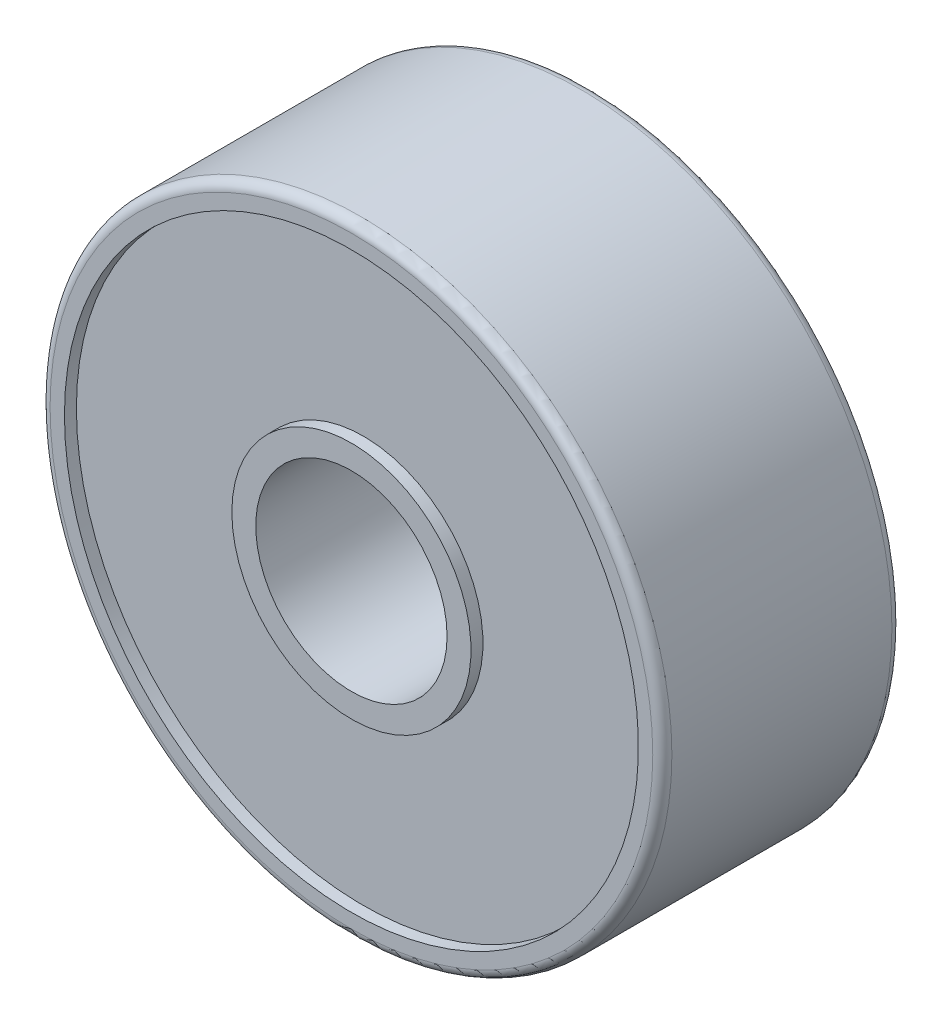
ISO-10303-21;
HEADER;
FILE_DESCRIPTION(('STEP AP214'),'2;1');
FILE_NAME('part.step','',(''),(''),'','','');
FILE_SCHEMA(('AUTOMOTIVE_DESIGN { 1 0 10303 214 1 1 1 1 }'));
ENDSEC;
DATA;
#1=APPLICATION_CONTEXT('core data for automotive mechanical design processes');
#2=APPLICATION_PROTOCOL_DEFINITION('international standard','automotive_design',2000,#1);
#3=PRODUCT_CONTEXT('',#1,'mechanical');
#4=PRODUCT('Part','Part','',(#3));
#5=PRODUCT_RELATED_PRODUCT_CATEGORY('part','',(#4));
#6=PRODUCT_DEFINITION_FORMATION('','',#4);
#7=PRODUCT_DEFINITION_CONTEXT('part definition',#1,'design');
#8=PRODUCT_DEFINITION('design','',#6,#7);
#9=PRODUCT_DEFINITION_SHAPE('','',#8);
#10=(LENGTH_UNIT() NAMED_UNIT(*) SI_UNIT(.MILLI.,.METRE.));
#11=(NAMED_UNIT(*) PLANE_ANGLE_UNIT() SI_UNIT($,.RADIAN.));
#12=(NAMED_UNIT(*) SI_UNIT($,.STERADIAN.) SOLID_ANGLE_UNIT());
#13=UNCERTAINTY_MEASURE_WITH_UNIT(LENGTH_MEASURE(1.E-05),#10,'distance_accuracy_value','');
#14=(GEOMETRIC_REPRESENTATION_CONTEXT(3) GLOBAL_UNCERTAINTY_ASSIGNED_CONTEXT((#13)) GLOBAL_UNIT_ASSIGNED_CONTEXT((#10,
#11,#12)) REPRESENTATION_CONTEXT('',''));
#15=CARTESIAN_POINT('',(0.,0.,0.));
#16=DIRECTION('',(0.,0.,1.));
#17=DIRECTION('',(1.,0.,0.));
#18=AXIS2_PLACEMENT_3D('',#15,#16,#17);
#19=CARTESIAN_POINT('',(0.,0.,0.));
#20=DIRECTION('',(0.,0.,1.));
#21=DIRECTION('',(1.,0.,0.));
#22=AXIS2_PLACEMENT_3D('',#19,#20,#21);
#23=CYLINDRICAL_SURFACE('',#22,2.);
#24=CARTESIAN_POINT('',(0.,0.,2.5));
#25=DIRECTION('',(0.,0.,1.));
#26=DIRECTION('',(1.,0.,0.));
#27=AXIS2_PLACEMENT_3D('',#24,#25,#26);
#28=CIRCLE('',#27,2.);
#29=CARTESIAN_POINT('',(2.,0.,2.5));
#30=VERTEX_POINT('',#29);
#31=EDGE_CURVE('E152',#30,#30,#28,.T.);
#32=ORIENTED_EDGE('',*,*,#31,.T.);
#33=EDGE_LOOP('',(#32));
#34=FACE_BOUND('',#33,.T.);
#35=CARTESIAN_POINT('',(0.,0.,-2.5));
#36=DIRECTION('',(0.,0.,1.));
#37=DIRECTION('',(1.,0.,0.));
#38=AXIS2_PLACEMENT_3D('',#35,#36,#37);
#39=CIRCLE('',#38,2.);
#40=CARTESIAN_POINT('',(2.,0.,-2.5));
#41=VERTEX_POINT('',#40);
#42=EDGE_CURVE('E18',#41,#41,#39,.T.);
#43=ORIENTED_EDGE('',*,*,#42,.F.);
#44=EDGE_LOOP('',(#43));
#45=FACE_BOUND('',#44,.T.);
#46=ADVANCED_FACE('F14',(#34,#45),#23,.F.);
#47=CARTESIAN_POINT('',(0.,0.,-2.5));
#48=DIRECTION('',(0.,0.,-1.));
#49=DIRECTION('',(-1.,0.,0.));
#50=AXIS2_PLACEMENT_3D('',#47,#48,#49);
#51=PLANE('',#50);
#52=ORIENTED_EDGE('',*,*,#42,.T.);
#53=EDGE_LOOP('',(#52));
#54=FACE_BOUND('',#53,.T.);
#55=CARTESIAN_POINT('',(0.,0.,-2.5));
#56=DIRECTION('',(0.,0.,1.));
#57=DIRECTION('',(0.,-1.,0.));
#58=AXIS2_PLACEMENT_3D('',#55,#56,#57);
#59=CIRCLE('',#58,2.5);
#60=CARTESIAN_POINT('',(0.,-2.5,-2.5));
#61=VERTEX_POINT('',#60);
#62=EDGE_CURVE('E150',#61,#61,#59,.T.);
#63=ORIENTED_EDGE('',*,*,#62,.F.);
#64=EDGE_LOOP('',(#63));
#65=FACE_BOUND('',#64,.T.);
#66=ADVANCED_FACE('F100',(#54,#65),#51,.T.);
#67=CARTESIAN_POINT('',(0.,0.,2.5));
#68=DIRECTION('',(0.,0.,-1.));
#69=DIRECTION('',(-1.,0.,0.));
#70=AXIS2_PLACEMENT_3D('',#67,#68,#69);
#71=PLANE('',#70);
#72=ORIENTED_EDGE('',*,*,#31,.F.);
#73=EDGE_LOOP('',(#72));
#74=FACE_BOUND('',#73,.T.);
#75=CARTESIAN_POINT('',(0.,0.,2.5));
#76=DIRECTION('',(0.,0.,-1.));
#77=DIRECTION('',(-1.,0.,0.));
#78=AXIS2_PLACEMENT_3D('',#75,#76,#77);
#79=CIRCLE('',#78,2.5);
#80=CARTESIAN_POINT('',(-2.5,0.,2.5));
#81=VERTEX_POINT('',#80);
#82=EDGE_CURVE('E147',#81,#81,#79,.T.);
#83=ORIENTED_EDGE('',*,*,#82,.F.);
#84=EDGE_LOOP('',(#83));
#85=FACE_BOUND('',#84,.T.);
#86=ADVANCED_FACE('F97',(#74,#85),#71,.F.);
#87=CARTESIAN_POINT('',(0.,0.,-2.5));
#88=DIRECTION('',(0.,0.,1.));
#89=DIRECTION('',(0.,-1.,0.));
#90=AXIS2_PLACEMENT_3D('',#87,#88,#89);
#91=CYLINDRICAL_SURFACE('',#90,2.5);
#92=ORIENTED_EDGE('',*,*,#62,.T.);
#93=EDGE_LOOP('',(#92));
#94=FACE_BOUND('',#93,.T.);
#95=CARTESIAN_POINT('',(0.,0.,-2.25));
#96=DIRECTION('',(0.,0.,1.));
#97=DIRECTION('',(0.,-1.,0.));
#98=AXIS2_PLACEMENT_3D('',#95,#96,#97);
#99=CIRCLE('',#98,2.5);
#100=CARTESIAN_POINT('',(0.,-2.5,-2.25));
#101=VERTEX_POINT('',#100);
#102=EDGE_CURVE('E144',#101,#101,#99,.F.);
#103=ORIENTED_EDGE('',*,*,#102,.T.);
#104=EDGE_LOOP('',(#103));
#105=FACE_BOUND('',#104,.T.);
#106=ADVANCED_FACE('F95',(#94,#105),#91,.T.);
#107=CARTESIAN_POINT('',(0.,0.,2.5));
#108=DIRECTION('',(0.,0.,-1.));
#109=DIRECTION('',(-1.,0.,0.));
#110=AXIS2_PLACEMENT_3D('',#107,#108,#109);
#111=CYLINDRICAL_SURFACE('',#110,2.5);
#112=ORIENTED_EDGE('',*,*,#82,.T.);
#113=EDGE_LOOP('',(#112));
#114=FACE_BOUND('',#113,.T.);
#115=CARTESIAN_POINT('',(0.,0.,2.25));
#116=DIRECTION('',(0.,0.,-1.));
#117=DIRECTION('',(-1.,0.,0.));
#118=AXIS2_PLACEMENT_3D('',#115,#116,#117);
#119=CIRCLE('',#118,2.5);
#120=CARTESIAN_POINT('',(-2.5,0.,2.25));
#121=VERTEX_POINT('',#120);
#122=EDGE_CURVE('E141',#121,#121,#119,.F.);
#123=ORIENTED_EDGE('',*,*,#122,.T.);
#124=EDGE_LOOP('',(#123));
#125=FACE_BOUND('',#124,.T.);
#126=ADVANCED_FACE('F92',(#114,#125),#111,.T.);
#127=CARTESIAN_POINT('',(6.12,6.12,-2.25));
#128=DIRECTION('',(0.,0.,1.));
#129=DIRECTION('',(-1.,0.,0.));
#130=AXIS2_PLACEMENT_3D('',#127,#128,#129);
#131=PLANE('',#130);
#132=ORIENTED_EDGE('',*,*,#102,.F.);
#133=EDGE_LOOP('',(#132));
#134=FACE_BOUND('',#133,.T.);
#135=CARTESIAN_POINT('',(0.,0.,-2.25));
#136=DIRECTION('',(0.,0.,1.));
#137=DIRECTION('',(0.,-1.,0.));
#138=AXIS2_PLACEMENT_3D('',#135,#136,#137);
#139=CIRCLE('',#138,6.);
#140=CARTESIAN_POINT('',(0.,-6.,-2.25));
#141=VERTEX_POINT('',#140);
#142=EDGE_CURVE('E138',#141,#141,#139,.F.);
#143=ORIENTED_EDGE('',*,*,#142,.T.);
#144=EDGE_LOOP('',(#143));
#145=FACE_BOUND('',#144,.T.);
#146=ADVANCED_FACE('F90',(#134,#145),#131,.F.);
#147=CARTESIAN_POINT('',(0.,0.,2.25));
#148=DIRECTION('',(0.,0.,-1.));
#149=DIRECTION('',(-1.,0.,0.));
#150=AXIS2_PLACEMENT_3D('',#147,#148,#149);
#151=PLANE('',#150);
#152=ORIENTED_EDGE('',*,*,#122,.F.);
#153=EDGE_LOOP('',(#152));
#154=FACE_BOUND('',#153,.T.);
#155=CARTESIAN_POINT('',(0.,0.,2.25));
#156=DIRECTION('',(0.,0.,-1.));
#157=DIRECTION('',(-1.,0.,0.));
#158=AXIS2_PLACEMENT_3D('',#155,#156,#157);
#159=CIRCLE('',#158,6.);
#160=CARTESIAN_POINT('',(-6.,0.,2.25));
#161=VERTEX_POINT('',#160);
#162=EDGE_CURVE('E131',#161,#161,#159,.F.);
#163=ORIENTED_EDGE('',*,*,#162,.T.);
#164=EDGE_LOOP('',(#163));
#165=FACE_BOUND('',#164,.T.);
#166=ADVANCED_FACE('F87',(#154,#165),#151,.F.);
#167=CARTESIAN_POINT('',(0.,0.,-2.5));
#168=DIRECTION('',(0.,0.,1.));
#169=DIRECTION('',(0.,-1.,0.));
#170=AXIS2_PLACEMENT_3D('',#167,#168,#169);
#171=CYLINDRICAL_SURFACE('',#170,6.);
#172=CARTESIAN_POINT('',(0.,0.,-2.5));
#173=DIRECTION('',(0.,0.,1.));
#174=DIRECTION('',(0.,-1.,0.));
#175=AXIS2_PLACEMENT_3D('',#172,#173,#174);
#176=CIRCLE('',#175,6.);
#177=CARTESIAN_POINT('',(0.,-6.,-2.5));
#178=VERTEX_POINT('',#177);
#179=EDGE_CURVE('E127',#178,#178,#176,.T.);
#180=ORIENTED_EDGE('',*,*,#179,.F.);
#181=EDGE_LOOP('',(#180));
#182=FACE_BOUND('',#181,.T.);
#183=ORIENTED_EDGE('',*,*,#142,.F.);
#184=EDGE_LOOP('',(#183));
#185=FACE_BOUND('',#184,.T.);
#186=ADVANCED_FACE('F16',(#182,#185),#171,.F.);
#187=CARTESIAN_POINT('',(0.,0.,2.5));
#188=DIRECTION('',(0.,0.,-1.));
#189=DIRECTION('',(-1.,0.,0.));
#190=AXIS2_PLACEMENT_3D('',#187,#188,#189);
#191=CYLINDRICAL_SURFACE('',#190,6.);
#192=CARTESIAN_POINT('',(0.,0.,2.5));
#193=DIRECTION('',(0.,0.,-1.));
#194=DIRECTION('',(-1.,0.,0.));
#195=AXIS2_PLACEMENT_3D('',#192,#193,#194);
#196=CIRCLE('',#195,6.);
#197=CARTESIAN_POINT('',(-6.,0.,2.5));
#198=VERTEX_POINT('',#197);
#199=EDGE_CURVE('E125',#198,#198,#196,.F.);
#200=ORIENTED_EDGE('',*,*,#199,.T.);
#201=EDGE_LOOP('',(#200));
#202=FACE_BOUND('',#201,.T.);
#203=ORIENTED_EDGE('',*,*,#162,.F.);
#204=EDGE_LOOP('',(#203));
#205=FACE_BOUND('',#204,.T.);
#206=ADVANCED_FACE('F81',(#202,#205),#191,.F.);
#207=CARTESIAN_POINT('',(0.,0.,-2.5));
#208=DIRECTION('',(0.,0.,-1.));
#209=DIRECTION('',(-1.,0.,0.));
#210=AXIS2_PLACEMENT_3D('',#207,#208,#209);
#211=PLANE('',#210);
#212=ORIENTED_EDGE('',*,*,#179,.T.);
#213=EDGE_LOOP('',(#212));
#214=FACE_BOUND('',#213,.T.);
#215=CARTESIAN_POINT('',(0.,0.,-2.5));
#216=DIRECTION('',(0.,0.,1.));
#217=DIRECTION('',(1.,0.,0.));
#218=AXIS2_PLACEMENT_3D('',#215,#216,#217);
#219=CIRCLE('',#218,6.3);
#220=CARTESIAN_POINT('',(6.3,0.,-2.5));
#221=VERTEX_POINT('',#220);
#222=EDGE_CURVE('E65',#221,#221,#219,.T.);
#223=ORIENTED_EDGE('',*,*,#222,.F.);
#224=EDGE_LOOP('',(#223));
#225=FACE_BOUND('',#224,.T.);
#226=ADVANCED_FACE('F71',(#214,#225),#211,.T.);
#227=CARTESIAN_POINT('',(0.,0.,2.5));
#228=DIRECTION('',(0.,0.,-1.));
#229=DIRECTION('',(-1.,0.,0.));
#230=AXIS2_PLACEMENT_3D('',#227,#228,#229);
#231=PLANE('',#230);
#232=ORIENTED_EDGE('',*,*,#199,.F.);
#233=EDGE_LOOP('',(#232));
#234=FACE_BOUND('',#233,.T.);
#235=CARTESIAN_POINT('',(0.,0.,2.5));
#236=DIRECTION('',(0.,0.,-1.));
#237=DIRECTION('',(1.,0.,0.));
#238=AXIS2_PLACEMENT_3D('',#235,#236,#237);
#239=CIRCLE('',#238,6.3);
#240=CARTESIAN_POINT('',(6.3,0.,2.5));
#241=VERTEX_POINT('',#240);
#242=EDGE_CURVE('E27',#241,#241,#239,.T.);
#243=ORIENTED_EDGE('',*,*,#242,.F.);
#244=EDGE_LOOP('',(#243));
#245=FACE_BOUND('',#244,.T.);
#246=ADVANCED_FACE('F80',(#234,#245),#231,.F.);
#247=CARTESIAN_POINT('',(0.,0.,-2.3));
#248=DIRECTION('',(0.,0.,1.));
#249=DIRECTION('',(1.,0.,0.));
#250=AXIS2_PLACEMENT_3D('',#247,#248,#249);
#251=TOROIDAL_SURFACE('',#250,6.3,0.2);
#252=CARTESIAN_POINT('',(0.,0.,-2.3));
#253=DIRECTION('',(0.,0.,1.));
#254=DIRECTION('',(1.,0.,0.));
#255=AXIS2_PLACEMENT_3D('',#252,#253,#254);
#256=CIRCLE('',#255,6.5);
#257=CARTESIAN_POINT('',(6.5,0.,-2.3));
#258=VERTEX_POINT('',#257);
#259=EDGE_CURVE('E22',#258,#258,#256,.T.);
#260=ORIENTED_EDGE('',*,*,#259,.F.);
#261=EDGE_LOOP('',(#260));
#262=FACE_BOUND('',#261,.T.);
#263=ORIENTED_EDGE('',*,*,#222,.T.);
#264=EDGE_LOOP('',(#263));
#265=FACE_BOUND('',#264,.T.);
#266=ADVANCED_FACE('F45',(#262,#265),#251,.T.);
#267=CARTESIAN_POINT('',(0.,0.,2.3));
#268=DIRECTION('',(0.,0.,-1.));
#269=DIRECTION('',(-1.,0.,0.));
#270=AXIS2_PLACEMENT_3D('',#267,#268,#269);
#271=TOROIDAL_SURFACE('',#270,6.3,0.2);
#272=CARTESIAN_POINT('',(0.,0.,2.3));
#273=DIRECTION('',(0.,0.,1.));
#274=DIRECTION('',(1.,0.,0.));
#275=AXIS2_PLACEMENT_3D('',#272,#273,#274);
#276=CIRCLE('',#275,6.5);
#277=CARTESIAN_POINT('',(6.5,0.,2.3));
#278=VERTEX_POINT('',#277);
#279=EDGE_CURVE('E10',#278,#278,#276,.F.);
#280=ORIENTED_EDGE('',*,*,#279,.F.);
#281=EDGE_LOOP('',(#280));
#282=FACE_BOUND('',#281,.T.);
#283=ORIENTED_EDGE('',*,*,#242,.T.);
#284=EDGE_LOOP('',(#283));
#285=FACE_BOUND('',#284,.T.);
#286=ADVANCED_FACE('F39',(#282,#285),#271,.T.);
#287=CARTESIAN_POINT('',(0.,0.,0.));
#288=DIRECTION('',(0.,0.,1.));
#289=DIRECTION('',(1.,0.,0.));
#290=AXIS2_PLACEMENT_3D('',#287,#288,#289);
#291=CYLINDRICAL_SURFACE('',#290,6.5);
#292=ORIENTED_EDGE('',*,*,#279,.T.);
#293=EDGE_LOOP('',(#292));
#294=FACE_BOUND('',#293,.T.);
#295=ORIENTED_EDGE('',*,*,#259,.T.);
#296=EDGE_LOOP('',(#295));
#297=FACE_BOUND('',#296,.T.);
#298=ADVANCED_FACE('F44',(#294,#297),#291,.T.);
#299=CLOSED_SHELL('',(#46,#66,#86,#106,#126,#146,#166,#186,#206,#226,#246,#266,#286,#298));
#300=MANIFOLD_SOLID_BREP('B1',#299);
#301=ADVANCED_BREP_SHAPE_REPRESENTATION('',(#18,#300),#14);
#302=SHAPE_DEFINITION_REPRESENTATION(#9,#301);
ENDSEC;
END-ISO-10303-21;
